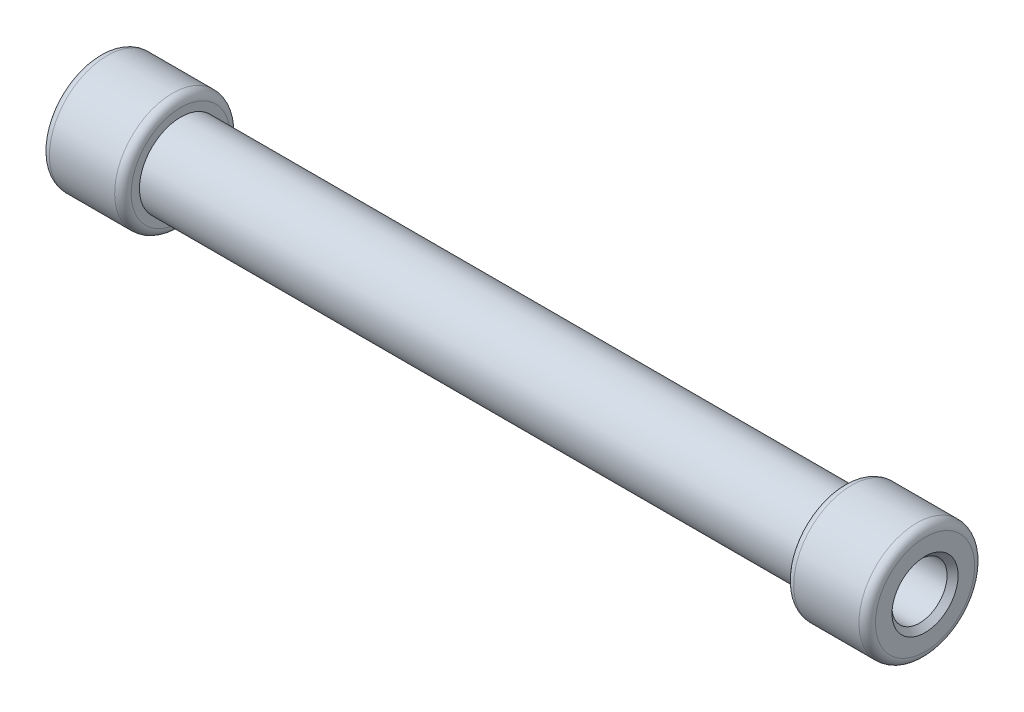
ISO-10303-21;
HEADER;
FILE_DESCRIPTION(('STEP AP214'),'2;1');
FILE_NAME('part.step','',(''),(''),'','','');
FILE_SCHEMA(('AUTOMOTIVE_DESIGN { 1 0 10303 214 1 1 1 1 }'));
ENDSEC;
DATA;
#1=APPLICATION_CONTEXT('core data for automotive mechanical design processes');
#2=APPLICATION_PROTOCOL_DEFINITION('international standard','automotive_design',2000,#1);
#3=PRODUCT_CONTEXT('',#1,'mechanical');
#4=PRODUCT('Part','Part','',(#3));
#5=PRODUCT_RELATED_PRODUCT_CATEGORY('part','',(#4));
#6=PRODUCT_DEFINITION_FORMATION('','',#4);
#7=PRODUCT_DEFINITION_CONTEXT('part definition',#1,'design');
#8=PRODUCT_DEFINITION('design','',#6,#7);
#9=PRODUCT_DEFINITION_SHAPE('','',#8);
#10=(LENGTH_UNIT() NAMED_UNIT(*) SI_UNIT(.MILLI.,.METRE.));
#11=(NAMED_UNIT(*) PLANE_ANGLE_UNIT() SI_UNIT($,.RADIAN.));
#12=(NAMED_UNIT(*) SI_UNIT($,.STERADIAN.) SOLID_ANGLE_UNIT());
#13=UNCERTAINTY_MEASURE_WITH_UNIT(LENGTH_MEASURE(1.E-05),#10,'distance_accuracy_value','');
#14=(GEOMETRIC_REPRESENTATION_CONTEXT(3) GLOBAL_UNCERTAINTY_ASSIGNED_CONTEXT((#13)) GLOBAL_UNIT_ASSIGNED_CONTEXT((#10,
#11,#12)) REPRESENTATION_CONTEXT('',''));
#15=CARTESIAN_POINT('',(0.,0.,0.));
#16=DIRECTION('',(0.,0.,1.));
#17=DIRECTION('',(1.,0.,0.));
#18=AXIS2_PLACEMENT_3D('',#15,#16,#17);
#19=CARTESIAN_POINT('',(40.1,0.,3.33333333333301));
#20=DIRECTION('',(-1.,0.,0.));
#21=DIRECTION('',(0.,-1.,0.));
#22=AXIS2_PLACEMENT_3D('',#19,#20,#21);
#23=PLANE('',#22);
#24=CARTESIAN_POINT('',(40.1,0.,0.));
#25=DIRECTION('',(1.,0.,0.));
#26=DIRECTION('',(0.,1.,0.));
#27=AXIS2_PLACEMENT_3D('',#24,#25,#26);
#28=CIRCLE('',#27,3.33333333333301);
#29=CARTESIAN_POINT('',(40.1,3.33333333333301,0.));
#30=VERTEX_POINT('',#29);
#31=EDGE_CURVE('E65',#30,#30,#28,.T.);
#32=ORIENTED_EDGE('',*,*,#31,.T.);
#33=EDGE_LOOP('',(#32));
#34=FACE_BOUND('',#33,.T.);
#35=ADVANCED_FACE('F12',(#34),#23,.F.);
#36=CARTESIAN_POINT('',(50.,0.,0.));
#37=DIRECTION('',(1.,0.,0.));
#38=DIRECTION('',(0.,1.,0.));
#39=AXIS2_PLACEMENT_3D('',#36,#37,#38);
#40=CYLINDRICAL_SURFACE('',#39,3.33333333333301);
#41=ORIENTED_EDGE('',*,*,#31,.F.);
#42=EDGE_LOOP('',(#41));
#43=FACE_BOUND('',#42,.T.);
#44=CARTESIAN_POINT('',(49.333333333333,0.,0.));
#45=DIRECTION('',(1.,0.,0.));
#46=DIRECTION('',(0.,1.,0.));
#47=AXIS2_PLACEMENT_3D('',#44,#45,#46);
#48=CIRCLE('',#47,3.33333333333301);
#49=CARTESIAN_POINT('',(49.333333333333,3.33333333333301,0.));
#50=VERTEX_POINT('',#49);
#51=EDGE_CURVE('E62',#50,#50,#48,.T.);
#52=ORIENTED_EDGE('',*,*,#51,.T.);
#53=EDGE_LOOP('',(#52));
#54=FACE_BOUND('',#53,.T.);
#55=ADVANCED_FACE('F70',(#43,#54),#40,.F.);
#56=CARTESIAN_POINT('',(50.,0.,0.));
#57=DIRECTION('',(1.,0.,0.));
#58=DIRECTION('',(0.,1.,0.));
#59=AXIS2_PLACEMENT_3D('',#56,#57,#58);
#60=CONICAL_SURFACE('',#59,4.,0.785398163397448);
#61=ORIENTED_EDGE('',*,*,#51,.F.);
#62=EDGE_LOOP('',(#61));
#63=FACE_BOUND('',#62,.T.);
#64=CARTESIAN_POINT('',(50.,0.,0.));
#65=DIRECTION('',(1.,0.,0.));
#66=DIRECTION('',(0.,1.,0.));
#67=AXIS2_PLACEMENT_3D('',#64,#65,#66);
#68=CIRCLE('',#67,4.);
#69=CARTESIAN_POINT('',(50.,4.,0.));
#70=VERTEX_POINT('',#69);
#71=EDGE_CURVE('E59',#70,#70,#68,.T.);
#72=ORIENTED_EDGE('',*,*,#71,.T.);
#73=EDGE_LOOP('',(#72));
#74=FACE_BOUND('',#73,.T.);
#75=ADVANCED_FACE('F73',(#63,#74),#60,.F.);
#76=CARTESIAN_POINT('',(50.,0.,6.));
#77=DIRECTION('',(-1.,0.,0.));
#78=DIRECTION('',(0.,-1.,0.));
#79=AXIS2_PLACEMENT_3D('',#76,#77,#78);
#80=PLANE('',#79);
#81=ORIENTED_EDGE('',*,*,#71,.F.);
#82=EDGE_LOOP('',(#81));
#83=FACE_BOUND('',#82,.T.);
#84=CARTESIAN_POINT('',(50.,0.,0.));
#85=DIRECTION('',(1.,0.,0.));
#86=DIRECTION('',(0.,1.,0.));
#87=AXIS2_PLACEMENT_3D('',#84,#85,#86);
#88=CIRCLE('',#87,6.00000000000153);
#89=CARTESIAN_POINT('',(50.,6.00000000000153,0.));
#90=VERTEX_POINT('',#89);
#91=EDGE_CURVE('E56',#90,#90,#88,.T.);
#92=ORIENTED_EDGE('',*,*,#91,.T.);
#93=EDGE_LOOP('',(#92));
#94=FACE_BOUND('',#93,.T.);
#95=ADVANCED_FACE('F79',(#83,#94),#80,.F.);
#96=CARTESIAN_POINT('',(49.0000000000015,0.,0.));
#97=DIRECTION('',(1.,0.,0.));
#98=DIRECTION('',(0.,1.,0.));
#99=AXIS2_PLACEMENT_3D('',#96,#97,#98);
#100=TOROIDAL_SURFACE('',#99,6.00000000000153,0.999999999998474);
#101=CARTESIAN_POINT('',(49.,0.,0.));
#102=DIRECTION('',(1.,0.,0.));
#103=DIRECTION('',(0.,1.,0.));
#104=AXIS2_PLACEMENT_3D('',#101,#102,#103);
#105=CIRCLE('',#104,7.);
#106=CARTESIAN_POINT('',(49.,7.,0.));
#107=VERTEX_POINT('',#106);
#108=EDGE_CURVE('E53',#107,#107,#105,.T.);
#109=ORIENTED_EDGE('',*,*,#108,.T.);
#110=EDGE_LOOP('',(#109));
#111=FACE_BOUND('',#110,.T.);
#112=ORIENTED_EDGE('',*,*,#91,.F.);
#113=EDGE_LOOP('',(#112));
#114=FACE_BOUND('',#113,.T.);
#115=ADVANCED_FACE('F85',(#111,#114),#100,.T.);
#116=CARTESIAN_POINT('',(50.,0.,0.));
#117=DIRECTION('',(1.,0.,0.));
#118=DIRECTION('',(0.,1.,0.));
#119=AXIS2_PLACEMENT_3D('',#116,#117,#118);
#120=CYLINDRICAL_SURFACE('',#119,7.);
#121=ORIENTED_EDGE('',*,*,#108,.F.);
#122=EDGE_LOOP('',(#121));
#123=FACE_BOUND('',#122,.T.);
#124=CARTESIAN_POINT('',(41.0999999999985,0.,0.));
#125=DIRECTION('',(1.,0.,0.));
#126=DIRECTION('',(0.,1.,0.));
#127=AXIS2_PLACEMENT_3D('',#124,#125,#126);
#128=CIRCLE('',#127,7.);
#129=CARTESIAN_POINT('',(41.0999999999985,7.,0.));
#130=VERTEX_POINT('',#129);
#131=EDGE_CURVE('E50',#130,#130,#128,.T.);
#132=ORIENTED_EDGE('',*,*,#131,.T.);
#133=EDGE_LOOP('',(#132));
#134=FACE_BOUND('',#133,.T.);
#135=ADVANCED_FACE('F90',(#123,#134),#120,.T.);
#136=CARTESIAN_POINT('',(41.0999999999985,0.,0.));
#137=DIRECTION('',(1.,0.,0.));
#138=DIRECTION('',(0.,1.,0.));
#139=AXIS2_PLACEMENT_3D('',#136,#137,#138);
#140=TOROIDAL_SURFACE('',#139,6.00000000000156,0.999999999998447);
#141=CARTESIAN_POINT('',(40.1,0.,0.));
#142=DIRECTION('',(1.,0.,0.));
#143=DIRECTION('',(0.,1.,0.));
#144=AXIS2_PLACEMENT_3D('',#141,#142,#143);
#145=CIRCLE('',#144,6.);
#146=CARTESIAN_POINT('',(40.1,6.,0.));
#147=VERTEX_POINT('',#146);
#148=EDGE_CURVE('E47',#147,#147,#145,.T.);
#149=ORIENTED_EDGE('',*,*,#148,.T.);
#150=EDGE_LOOP('',(#149));
#151=FACE_BOUND('',#150,.T.);
#152=ORIENTED_EDGE('',*,*,#131,.F.);
#153=EDGE_LOOP('',(#152));
#154=FACE_BOUND('',#153,.T.);
#155=ADVANCED_FACE('F98',(#151,#154),#140,.T.);
#156=CARTESIAN_POINT('',(40.1,0.,5.));
#157=DIRECTION('',(1.,0.,0.));
#158=DIRECTION('',(0.,1.,0.));
#159=AXIS2_PLACEMENT_3D('',#156,#157,#158);
#160=PLANE('',#159);
#161=ORIENTED_EDGE('',*,*,#148,.F.);
#162=EDGE_LOOP('',(#161));
#163=FACE_BOUND('',#162,.T.);
#164=CARTESIAN_POINT('',(40.1,0.,0.));
#165=DIRECTION('',(1.,0.,0.));
#166=DIRECTION('',(0.,1.,0.));
#167=AXIS2_PLACEMENT_3D('',#164,#165,#166);
#168=CIRCLE('',#167,5.);
#169=CARTESIAN_POINT('',(40.1,5.,0.));
#170=VERTEX_POINT('',#169);
#171=EDGE_CURVE('E44',#170,#170,#168,.T.);
#172=ORIENTED_EDGE('',*,*,#171,.T.);
#173=EDGE_LOOP('',(#172));
#174=FACE_BOUND('',#173,.T.);
#175=ADVANCED_FACE('F145',(#163,#174),#160,.F.);
#176=CARTESIAN_POINT('',(-40.1,0.,0.));
#177=DIRECTION('',(1.,0.,0.));
#178=DIRECTION('',(0.,1.,0.));
#179=AXIS2_PLACEMENT_3D('',#176,#177,#178);
#180=PLANE('',#179);
#181=CARTESIAN_POINT('',(-40.1,0.,0.));
#182=DIRECTION('',(1.,0.,0.));
#183=DIRECTION('',(0.,1.,0.));
#184=AXIS2_PLACEMENT_3D('',#181,#182,#183);
#185=CIRCLE('',#184,3.33333333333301);
#186=CARTESIAN_POINT('',(-40.1,3.33333333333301,0.));
#187=VERTEX_POINT('',#186);
#188=EDGE_CURVE('E8',#187,#187,#185,.T.);
#189=ORIENTED_EDGE('',*,*,#188,.F.);
#190=EDGE_LOOP('',(#189));
#191=FACE_BOUND('',#190,.T.);
#192=ADVANCED_FACE('F14',(#191),#180,.F.);
#193=CARTESIAN_POINT('',(50.,0.,0.));
#194=DIRECTION('',(1.,0.,0.));
#195=DIRECTION('',(0.,1.,0.));
#196=AXIS2_PLACEMENT_3D('',#193,#194,#195);
#197=CYLINDRICAL_SURFACE('',#196,3.33333333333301);
#198=CARTESIAN_POINT('',(-49.333333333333,0.,0.));
#199=DIRECTION('',(1.,0.,0.));
#200=DIRECTION('',(0.,1.,0.));
#201=AXIS2_PLACEMENT_3D('',#198,#199,#200);
#202=CIRCLE('',#201,3.33333333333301);
#203=CARTESIAN_POINT('',(-49.333333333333,3.33333333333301,0.));
#204=VERTEX_POINT('',#203);
#205=EDGE_CURVE('E19',#204,#204,#202,.T.);
#206=ORIENTED_EDGE('',*,*,#205,.F.);
#207=EDGE_LOOP('',(#206));
#208=FACE_BOUND('',#207,.T.);
#209=ORIENTED_EDGE('',*,*,#188,.T.);
#210=EDGE_LOOP('',(#209));
#211=FACE_BOUND('',#210,.T.);
#212=ADVANCED_FACE('F161',(#208,#211),#197,.F.);
#213=CARTESIAN_POINT('',(-49.333333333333,0.,0.));
#214=DIRECTION('',(-1.,0.,0.));
#215=DIRECTION('',(0.,-1.,0.));
#216=AXIS2_PLACEMENT_3D('',#213,#214,#215);
#217=CONICAL_SURFACE('',#216,3.33333333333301,0.785398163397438);
#218=CARTESIAN_POINT('',(-50.,0.,0.));
#219=DIRECTION('',(1.,0.,0.));
#220=DIRECTION('',(0.,1.,0.));
#221=AXIS2_PLACEMENT_3D('',#218,#219,#220);
#222=CIRCLE('',#221,4.);
#223=CARTESIAN_POINT('',(-50.,4.,0.));
#224=VERTEX_POINT('',#223);
#225=EDGE_CURVE('E23',#224,#224,#222,.T.);
#226=ORIENTED_EDGE('',*,*,#225,.F.);
#227=EDGE_LOOP('',(#226));
#228=FACE_BOUND('',#227,.T.);
#229=ORIENTED_EDGE('',*,*,#205,.T.);
#230=EDGE_LOOP('',(#229));
#231=FACE_BOUND('',#230,.T.);
#232=ADVANCED_FACE('F169',(#228,#231),#217,.F.);
#233=CARTESIAN_POINT('',(-50.,0.,4.));
#234=DIRECTION('',(1.,0.,0.));
#235=DIRECTION('',(0.,1.,0.));
#236=AXIS2_PLACEMENT_3D('',#233,#234,#235);
#237=PLANE('',#236);
#238=CARTESIAN_POINT('',(-50.,0.,0.));
#239=DIRECTION('',(1.,0.,0.));
#240=DIRECTION('',(0.,1.,0.));
#241=AXIS2_PLACEMENT_3D('',#238,#239,#240);
#242=CIRCLE('',#241,6.);
#243=CARTESIAN_POINT('',(-50.,6.,0.));
#244=VERTEX_POINT('',#243);
#245=EDGE_CURVE('E27',#244,#244,#242,.T.);
#246=ORIENTED_EDGE('',*,*,#245,.F.);
#247=EDGE_LOOP('',(#246));
#248=FACE_BOUND('',#247,.T.);
#249=ORIENTED_EDGE('',*,*,#225,.T.);
#250=EDGE_LOOP('',(#249));
#251=FACE_BOUND('',#250,.T.);
#252=ADVANCED_FACE('F177',(#248,#251),#237,.F.);
#253=CARTESIAN_POINT('',(-49.0000000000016,0.,0.));
#254=DIRECTION('',(1.,0.,0.));
#255=DIRECTION('',(0.,1.,0.));
#256=AXIS2_PLACEMENT_3D('',#253,#254,#255);
#257=TOROIDAL_SURFACE('',#256,6.00000000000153,0.999999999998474);
#258=ORIENTED_EDGE('',*,*,#245,.T.);
#259=EDGE_LOOP('',(#258));
#260=FACE_BOUND('',#259,.T.);
#261=CARTESIAN_POINT('',(-49.0000000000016,0.,0.));
#262=DIRECTION('',(1.,0.,0.));
#263=DIRECTION('',(0.,1.,0.));
#264=AXIS2_PLACEMENT_3D('',#261,#262,#263);
#265=CIRCLE('',#264,7.);
#266=CARTESIAN_POINT('',(-49.0000000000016,7.,0.));
#267=VERTEX_POINT('',#266);
#268=EDGE_CURVE('E32',#267,#267,#265,.T.);
#269=ORIENTED_EDGE('',*,*,#268,.F.);
#270=EDGE_LOOP('',(#269));
#271=FACE_BOUND('',#270,.T.);
#272=ADVANCED_FACE('F186',(#260,#271),#257,.T.);
#273=CARTESIAN_POINT('',(50.,0.,0.));
#274=DIRECTION('',(1.,0.,0.));
#275=DIRECTION('',(0.,1.,0.));
#276=AXIS2_PLACEMENT_3D('',#273,#274,#275);
#277=CYLINDRICAL_SURFACE('',#276,7.);
#278=CARTESIAN_POINT('',(-41.1,0.,0.));
#279=DIRECTION('',(1.,0.,0.));
#280=DIRECTION('',(0.,1.,0.));
#281=AXIS2_PLACEMENT_3D('',#278,#279,#280);
#282=CIRCLE('',#281,7.);
#283=CARTESIAN_POINT('',(-41.1,7.,0.));
#284=VERTEX_POINT('',#283);
#285=EDGE_CURVE('E35',#284,#284,#282,.T.);
#286=ORIENTED_EDGE('',*,*,#285,.F.);
#287=EDGE_LOOP('',(#286));
#288=FACE_BOUND('',#287,.T.);
#289=ORIENTED_EDGE('',*,*,#268,.T.);
#290=EDGE_LOOP('',(#289));
#291=FACE_BOUND('',#290,.T.);
#292=ADVANCED_FACE('F195',(#288,#291),#277,.T.);
#293=CARTESIAN_POINT('',(-41.0999999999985,0.,0.));
#294=DIRECTION('',(1.,0.,0.));
#295=DIRECTION('',(0.,1.,0.));
#296=AXIS2_PLACEMENT_3D('',#293,#294,#295);
#297=TOROIDAL_SURFACE('',#296,6.00000000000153,0.999999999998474);
#298=ORIENTED_EDGE('',*,*,#285,.T.);
#299=EDGE_LOOP('',(#298));
#300=FACE_BOUND('',#299,.T.);
#301=CARTESIAN_POINT('',(-40.1,0.,0.));
#302=DIRECTION('',(1.,0.,0.));
#303=DIRECTION('',(0.,1.,0.));
#304=AXIS2_PLACEMENT_3D('',#301,#302,#303);
#305=CIRCLE('',#304,6.00000000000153);
#306=CARTESIAN_POINT('',(-40.1,6.00000000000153,0.));
#307=VERTEX_POINT('',#306);
#308=EDGE_CURVE('E38',#307,#307,#305,.T.);
#309=ORIENTED_EDGE('',*,*,#308,.F.);
#310=EDGE_LOOP('',(#309));
#311=FACE_BOUND('',#310,.T.);
#312=ADVANCED_FACE('F204',(#300,#311),#297,.T.);
#313=CARTESIAN_POINT('',(-40.1,0.,6.));
#314=DIRECTION('',(-1.,0.,0.));
#315=DIRECTION('',(0.,-1.,0.));
#316=AXIS2_PLACEMENT_3D('',#313,#314,#315);
#317=PLANE('',#316);
#318=CARTESIAN_POINT('',(-40.1,0.,0.));
#319=DIRECTION('',(1.,0.,0.));
#320=DIRECTION('',(0.,1.,0.));
#321=AXIS2_PLACEMENT_3D('',#318,#319,#320);
#322=CIRCLE('',#321,5.);
#323=CARTESIAN_POINT('',(-40.1,5.,0.));
#324=VERTEX_POINT('',#323);
#325=EDGE_CURVE('E41',#324,#324,#322,.T.);
#326=ORIENTED_EDGE('',*,*,#325,.F.);
#327=EDGE_LOOP('',(#326));
#328=FACE_BOUND('',#327,.T.);
#329=ORIENTED_EDGE('',*,*,#308,.T.);
#330=EDGE_LOOP('',(#329));
#331=FACE_BOUND('',#330,.T.);
#332=ADVANCED_FACE('F213',(#328,#331),#317,.F.);
#333=CARTESIAN_POINT('',(50.,0.,0.));
#334=DIRECTION('',(1.,0.,0.));
#335=DIRECTION('',(0.,1.,0.));
#336=AXIS2_PLACEMENT_3D('',#333,#334,#335);
#337=CYLINDRICAL_SURFACE('',#336,5.);
#338=ORIENTED_EDGE('',*,*,#325,.T.);
#339=EDGE_LOOP('',(#338));
#340=FACE_BOUND('',#339,.T.);
#341=ORIENTED_EDGE('',*,*,#171,.F.);
#342=EDGE_LOOP('',(#341));
#343=FACE_BOUND('',#342,.T.);
#344=ADVANCED_FACE('F222',(#340,#343),#337,.T.);
#345=CLOSED_SHELL('',(#35,#55,#75,#95,#115,#135,#155,#175,#192,#212,#232,#252,#272,#292,#312,
#332,#344));
#346=MANIFOLD_SOLID_BREP('B1',#345);
#347=ADVANCED_BREP_SHAPE_REPRESENTATION('',(#18,#346),#14);
#348=SHAPE_DEFINITION_REPRESENTATION(#9,#347);
ENDSEC;
END-ISO-10303-21;
